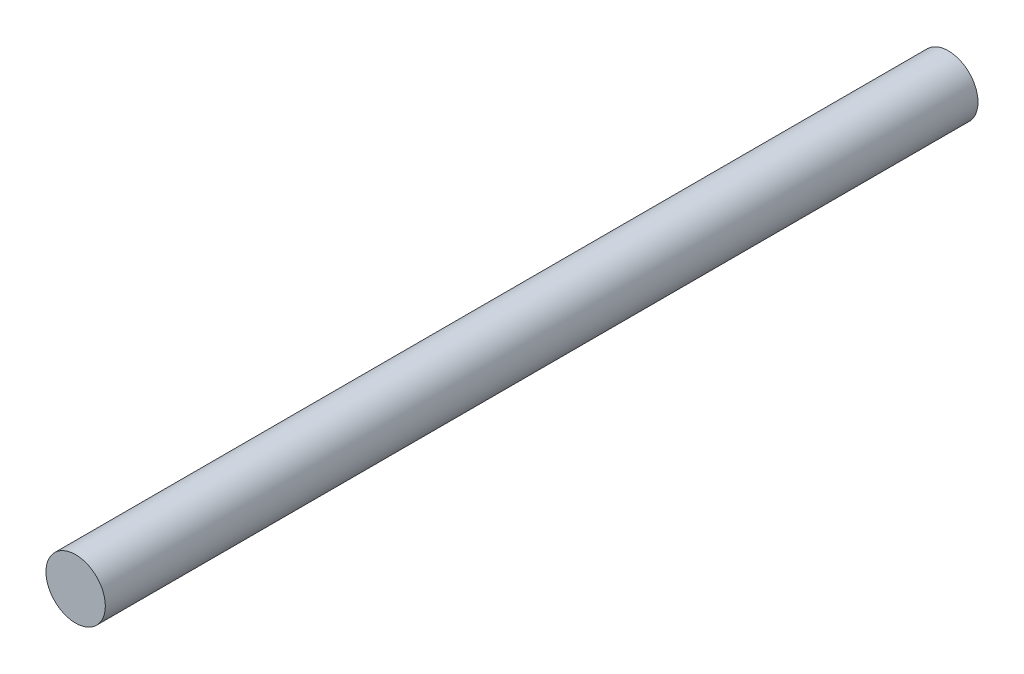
from build123d import *


with BuildPart() as part:
    # Esquisse3 → R_volution1 (revolve)
    with BuildSketch(Plane(origin=(41.872325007, 0, 0), x_dir=(0, 0, -1), z_dir=(1, 0, 0)), mode=Mode.PRIVATE) as r_volution1_sk:
        Polygon((-110.915342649, 63.584441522), (-280.615342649, 63.584441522), (-280.615342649, 57.811141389), (-177.115342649, 57.811141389), (-177.115342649, 60.811141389), (-110.915342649, 60.811141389), align=None)
    revolve(r_volution1_sk.sketch.rotate(Axis((41.872325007, 57.811141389, 280.615342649), (0, 0, -1)), 90), axis=Axis((41.872325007, 57.811141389, 280.615342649), (0, 0, -1)))

    # Esquisse4 → Enl_vement de mati_re-R_volution1 (revolve, cut)
    with BuildSketch(Plane(origin=(41.872325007, 0, 0), x_dir=(0, 0, -1), z_dir=(1, 0, 0)), mode=Mode.PRIVATE) as enl_vement_de_mati_re_r_volution1_sk:
        with BuildLine():
            Line((-177.115342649, 60.529970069), (-180.615342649, 60.529970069))
            ThreePointArc((-180.615342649, 60.529970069), (-181.676002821, 60.090630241), (-182.115342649, 59.029970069))
            Line((-182.115342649, 59.029970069), (-182.115342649, 57.529970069))
            Line((-182.115342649, 57.529970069), (-177.115342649, 57.529970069))
            Line((-177.115342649, 57.529970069), (-177.115342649, 60.529970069))
        make_face()
    revolve(enl_vement_de_mati_re_r_volution1_sk.sketch.rotate(Axis((41.872325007, 57.529970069, 182.115342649), (0, 0, -1)), 90), axis=Axis((41.872325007, 57.529970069, 182.115342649), (0, 0, -1)), mode=Mode.SUBTRACT)


solid = part.part
